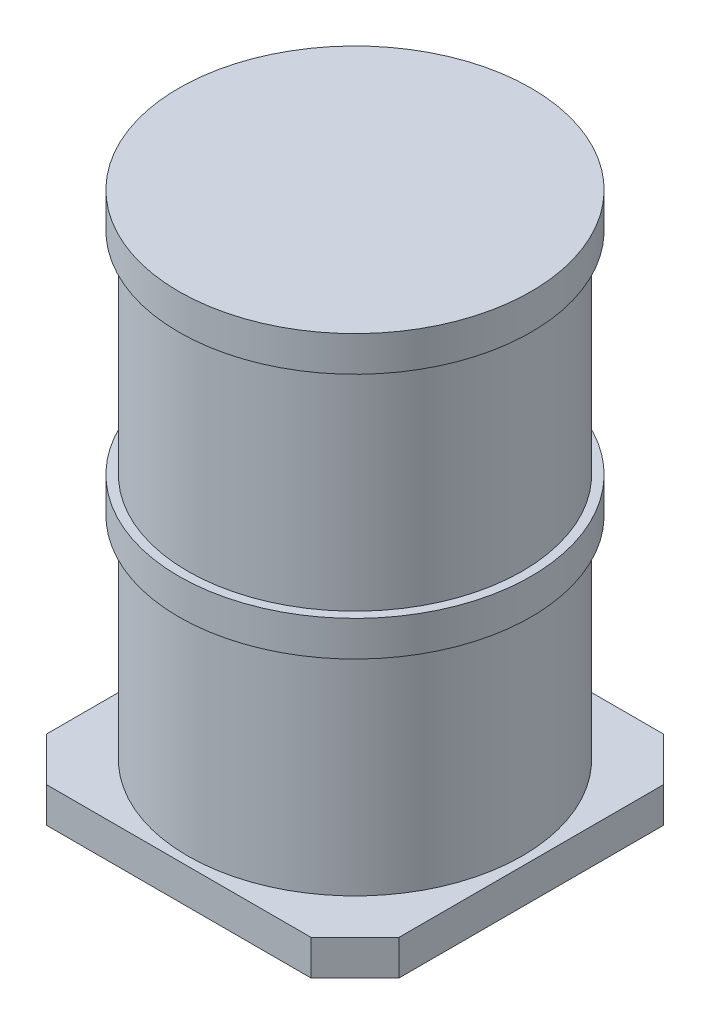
ISO-10303-21;
HEADER;
FILE_DESCRIPTION(('STEP AP214'),'2;1');
FILE_NAME('part.step','',(''),(''),'','','');
FILE_SCHEMA(('AUTOMOTIVE_DESIGN { 1 0 10303 214 1 1 1 1 }'));
ENDSEC;
DATA;
#1=APPLICATION_CONTEXT('core data for automotive mechanical design processes');
#2=APPLICATION_PROTOCOL_DEFINITION('international standard','automotive_design',2000,#1);
#3=PRODUCT_CONTEXT('',#1,'mechanical');
#4=PRODUCT('Part','Part','',(#3));
#5=PRODUCT_RELATED_PRODUCT_CATEGORY('part','',(#4));
#6=PRODUCT_DEFINITION_FORMATION('','',#4);
#7=PRODUCT_DEFINITION_CONTEXT('part definition',#1,'design');
#8=PRODUCT_DEFINITION('design','',#6,#7);
#9=PRODUCT_DEFINITION_SHAPE('','',#8);
#10=(LENGTH_UNIT() NAMED_UNIT(*) SI_UNIT(.MILLI.,.METRE.));
#11=(NAMED_UNIT(*) PLANE_ANGLE_UNIT() SI_UNIT($,.RADIAN.));
#12=(NAMED_UNIT(*) SI_UNIT($,.STERADIAN.) SOLID_ANGLE_UNIT());
#13=UNCERTAINTY_MEASURE_WITH_UNIT(LENGTH_MEASURE(1.E-05),#10,'distance_accuracy_value','');
#14=(GEOMETRIC_REPRESENTATION_CONTEXT(3) GLOBAL_UNCERTAINTY_ASSIGNED_CONTEXT((#13)) GLOBAL_UNIT_ASSIGNED_CONTEXT((#10,
#11,#12)) REPRESENTATION_CONTEXT('',''));
#15=CARTESIAN_POINT('',(0.,0.,0.));
#16=DIRECTION('',(0.,0.,1.));
#17=DIRECTION('',(1.,0.,0.));
#18=AXIS2_PLACEMENT_3D('',#15,#16,#17);
#19=CARTESIAN_POINT('',(0.,3.048,0.));
#20=DIRECTION('',(0.,-1.,0.));
#21=DIRECTION('',(0.,0.,-1.));
#22=AXIS2_PLACEMENT_3D('',#19,#20,#21);
#23=CYLINDRICAL_SURFACE('',#22,2.413);
#24=CARTESIAN_POINT('',(0.,3.048,0.));
#25=DIRECTION('',(0.,1.,0.));
#26=DIRECTION('',(0.,0.,1.));
#27=AXIS2_PLACEMENT_3D('',#24,#25,#26);
#28=CIRCLE('',#27,2.413);
#29=CARTESIAN_POINT('',(0.,3.048,-2.413));
#30=VERTEX_POINT('',#29);
#31=EDGE_CURVE('E169',#30,#30,#28,.T.);
#32=CARTESIAN_POINT('',(0.,0.,0.));
#33=DIRECTION('',(0.,1.,0.));
#34=DIRECTION('',(0.,0.,1.));
#35=AXIS2_PLACEMENT_3D('',#32,#33,#34);
#36=CIRCLE('',#35,2.413);
#37=CARTESIAN_POINT('',(0.,0.,-2.413));
#38=VERTEX_POINT('',#37);
#39=EDGE_CURVE('E155',#38,#38,#36,.T.);
#40=CARTESIAN_POINT('',(0.,3.048,-2.413));
#41=CARTESIAN_POINT('',(0.,3.01625,-2.413));
#42=CARTESIAN_POINT('',(0.,2.9845,-2.413));
#43=CARTESIAN_POINT('',(0.,2.921,-2.413));
#44=CARTESIAN_POINT('',(0.,2.88925,-2.413));
#45=CARTESIAN_POINT('',(0.,2.82575,-2.413));
#46=CARTESIAN_POINT('',(0.,2.794,-2.413));
#47=CARTESIAN_POINT('',(0.,2.7305,-2.413));
#48=CARTESIAN_POINT('',(0.,2.69875,-2.413));
#49=CARTESIAN_POINT('',(0.,2.63525,-2.413));
#50=CARTESIAN_POINT('',(0.,2.6035,-2.413));
#51=CARTESIAN_POINT('',(0.,2.54,-2.413));
#52=CARTESIAN_POINT('',(0.,2.50825,-2.413));
#53=CARTESIAN_POINT('',(0.,2.44475,-2.413));
#54=CARTESIAN_POINT('',(0.,2.413,-2.413));
#55=CARTESIAN_POINT('',(0.,2.3495,-2.413));
#56=CARTESIAN_POINT('',(0.,2.31775,-2.413));
#57=CARTESIAN_POINT('',(0.,2.25425,-2.413));
#58=CARTESIAN_POINT('',(0.,2.2225,-2.413));
#59=CARTESIAN_POINT('',(0.,2.159,-2.413));
#60=CARTESIAN_POINT('',(0.,2.12725,-2.413));
#61=CARTESIAN_POINT('',(0.,2.06375,-2.413));
#62=CARTESIAN_POINT('',(0.,2.032,-2.413));
#63=CARTESIAN_POINT('',(0.,1.9685,-2.413));
#64=CARTESIAN_POINT('',(0.,1.93675,-2.413));
#65=CARTESIAN_POINT('',(0.,1.87325,-2.413));
#66=CARTESIAN_POINT('',(0.,1.8415,-2.413));
#67=CARTESIAN_POINT('',(0.,1.778,-2.413));
#68=CARTESIAN_POINT('',(0.,1.74625,-2.413));
#69=CARTESIAN_POINT('',(0.,1.68275,-2.413));
#70=CARTESIAN_POINT('',(0.,1.651,-2.413));
#71=CARTESIAN_POINT('',(0.,1.5875,-2.413));
#72=CARTESIAN_POINT('',(0.,1.55575,-2.413));
#73=CARTESIAN_POINT('',(0.,1.49225,-2.413));
#74=CARTESIAN_POINT('',(0.,1.4605,-2.413));
#75=CARTESIAN_POINT('',(0.,1.397,-2.413));
#76=CARTESIAN_POINT('',(0.,1.36525,-2.413));
#77=CARTESIAN_POINT('',(0.,1.30175,-2.413));
#78=CARTESIAN_POINT('',(0.,1.27,-2.413));
#79=CARTESIAN_POINT('',(0.,1.2065,-2.413));
#80=CARTESIAN_POINT('',(0.,1.17475,-2.413));
#81=CARTESIAN_POINT('',(0.,1.11125,-2.413));
#82=CARTESIAN_POINT('',(0.,1.0795,-2.413));
#83=CARTESIAN_POINT('',(0.,1.016,-2.413));
#84=CARTESIAN_POINT('',(0.,0.98425,-2.413));
#85=CARTESIAN_POINT('',(0.,0.92075,-2.413));
#86=CARTESIAN_POINT('',(0.,0.889,-2.413));
#87=CARTESIAN_POINT('',(0.,0.8255,-2.413));
#88=CARTESIAN_POINT('',(0.,0.79375,-2.413));
#89=CARTESIAN_POINT('',(0.,0.73025,-2.413));
#90=CARTESIAN_POINT('',(0.,0.6985,-2.413));
#91=CARTESIAN_POINT('',(0.,0.635,-2.413));
#92=CARTESIAN_POINT('',(0.,0.60325,-2.413));
#93=CARTESIAN_POINT('',(0.,0.53975,-2.413));
#94=CARTESIAN_POINT('',(0.,0.508,-2.413));
#95=CARTESIAN_POINT('',(0.,0.4445,-2.413));
#96=CARTESIAN_POINT('',(0.,0.41275,-2.413));
#97=CARTESIAN_POINT('',(0.,0.34925,-2.413));
#98=CARTESIAN_POINT('',(0.,0.3175,-2.413));
#99=CARTESIAN_POINT('',(0.,0.254,-2.413));
#100=CARTESIAN_POINT('',(0.,0.22225,-2.413));
#101=CARTESIAN_POINT('',(0.,0.15875,-2.413));
#102=CARTESIAN_POINT('',(0.,0.127,-2.413));
#103=CARTESIAN_POINT('',(0.,0.0634999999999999,-2.413));
#104=CARTESIAN_POINT('',(0.,0.03175,-2.413));
#105=CARTESIAN_POINT('',(0.,0.,-2.413));
#106=B_SPLINE_CURVE_WITH_KNOTS('',3,(#40,#41,#42,#43,#44,#45,#46,#47,#48,#49,#50,#51,#52,#53,
#54,#55,#56,#57,#58,#59,#60,#61,#62,#63,#64,#65,#66,#67,#68,#69,#70,#71,#72,#73,#74,#75,#76,#77,
#78,#79,#80,#81,#82,#83,#84,#85,#86,#87,#88,#89,#90,#91,#92,#93,#94,#95,#96,#97,#98,#99,#100,
#101,#102,#103,#104,#105),.UNSPECIFIED.,.F.,.F.,(4,2,2,2,2,2,2,2,2,2,2,2,2,2,2,2,2,2,2,2,2,2,2,
2,2,2,2,2,2,2,2,2,4),(0.,0.0952499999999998,0.1905,0.28575,0.381,0.47625,0.5715,0.66675,0.762,
0.85725,0.9525,1.04775,1.143,1.23825,1.3335,1.42875,1.524,1.61925,1.7145,1.80975,1.905,2.00025,
2.0955,2.19075,2.286,2.38125,2.4765,2.57175,2.667,2.76225,2.8575,2.95275,3.048),.UNSPECIFIED.);
#107=EDGE_CURVE('BSEAM45',#30,#38,#106,.T.);
#108=ORIENTED_EDGE('',*,*,#31,.F.);
#109=ORIENTED_EDGE('',*,*,#39,.T.);
#110=ORIENTED_EDGE('',*,*,#107,.T.);
#111=ORIENTED_EDGE('',*,*,#107,.F.);
#112=EDGE_LOOP('',(#108,#110,#109,#111));
#113=FACE_BOUND('',#112,.T.);
#114=ADVANCED_FACE('F45',(#113),#23,.T.);
#115=CARTESIAN_POINT('',(0.,3.556,0.));
#116=DIRECTION('',(0.,-1.,0.));
#117=DIRECTION('',(0.,0.,-1.));
#118=AXIS2_PLACEMENT_3D('',#115,#116,#117);
#119=CYLINDRICAL_SURFACE('',#118,2.54);
#120=CARTESIAN_POINT('',(0.,3.556,0.));
#121=DIRECTION('',(0.,1.,0.));
#122=DIRECTION('',(0.,0.,1.));
#123=AXIS2_PLACEMENT_3D('',#120,#121,#122);
#124=CIRCLE('',#123,2.54);
#125=CARTESIAN_POINT('',(0.,3.556,2.54));
#126=VERTEX_POINT('',#125);
#127=EDGE_CURVE('E166',#126,#126,#124,.T.);
#128=ORIENTED_EDGE('',*,*,#127,.F.);
#129=EDGE_LOOP('',(#128));
#130=FACE_BOUND('',#129,.T.);
#131=CARTESIAN_POINT('',(0.,3.048,0.));
#132=DIRECTION('',(0.,1.,0.));
#133=DIRECTION('',(0.,0.,1.));
#134=AXIS2_PLACEMENT_3D('',#131,#132,#133);
#135=CIRCLE('',#134,2.54);
#136=CARTESIAN_POINT('',(0.,3.048,2.54));
#137=VERTEX_POINT('',#136);
#138=EDGE_CURVE('E161',#137,#137,#135,.T.);
#139=ORIENTED_EDGE('',*,*,#138,.T.);
#140=EDGE_LOOP('',(#139));
#141=FACE_BOUND('',#140,.T.);
#142=ADVANCED_FACE('F242',(#130,#141),#119,.T.);
#143=CARTESIAN_POINT('',(0.,3.556,0.));
#144=DIRECTION('',(0.,1.,0.));
#145=DIRECTION('',(0.,0.,1.));
#146=AXIS2_PLACEMENT_3D('',#143,#144,#145);
#147=PLANE('',#146);
#148=CARTESIAN_POINT('',(0.,3.556,0.));
#149=DIRECTION('',(0.,1.,0.));
#150=DIRECTION('',(0.,0.,1.));
#151=AXIS2_PLACEMENT_3D('',#148,#149,#150);
#152=CIRCLE('',#151,2.413);
#153=CARTESIAN_POINT('',(0.,3.556,-2.413));
#154=VERTEX_POINT('',#153);
#155=EDGE_CURVE('E13',#154,#154,#152,.T.);
#156=ORIENTED_EDGE('',*,*,#155,.F.);
#157=EDGE_LOOP('',(#156));
#158=FACE_BOUND('',#157,.T.);
#159=ORIENTED_EDGE('',*,*,#127,.T.);
#160=EDGE_LOOP('',(#159));
#161=FACE_BOUND('',#160,.T.);
#162=ADVANCED_FACE('F248',(#158,#161),#147,.T.);
#163=CARTESIAN_POINT('',(0.,3.048,0.));
#164=DIRECTION('',(0.,1.,0.));
#165=DIRECTION('',(0.,0.,1.));
#166=AXIS2_PLACEMENT_3D('',#163,#164,#165);
#167=PLANE('',#166);
#168=ORIENTED_EDGE('',*,*,#31,.T.);
#169=EDGE_LOOP('',(#168));
#170=FACE_BOUND('',#169,.T.);
#171=ORIENTED_EDGE('',*,*,#138,.F.);
#172=EDGE_LOOP('',(#171));
#173=FACE_BOUND('',#172,.T.);
#174=ADVANCED_FACE('F298',(#170,#173),#167,.F.);
#175=CARTESIAN_POINT('',(2.54,-0.508,-2.54));
#176=DIRECTION('',(-1.,0.,0.));
#177=DIRECTION('',(0.,0.,1.));
#178=AXIS2_PLACEMENT_3D('',#175,#176,#177);
#179=PLANE('',#178);
#180=DIRECTION('',(0.,0.,1.));
#181=VECTOR('',#180,1.);
#182=CARTESIAN_POINT('',(2.54,-0.508,-2.54));
#183=LINE('',#182,#181);
#184=CARTESIAN_POINT('',(2.54,-0.508,-1.905));
#185=VERTEX_POINT('',#184);
#186=CARTESIAN_POINT('',(2.54,-0.508,1.905));
#187=VERTEX_POINT('',#186);
#188=EDGE_CURVE('E133',#185,#187,#183,.T.);
#189=ORIENTED_EDGE('',*,*,#188,.F.);
#190=DIRECTION('',(0.,1.,0.));
#191=VECTOR('',#190,1.);
#192=CARTESIAN_POINT('',(2.54,-0.508,-1.905));
#193=LINE('',#192,#191);
#194=CARTESIAN_POINT('',(2.54,0.,-1.905));
#195=VERTEX_POINT('',#194);
#196=EDGE_CURVE('E117',#185,#195,#193,.T.);
#197=ORIENTED_EDGE('',*,*,#196,.T.);
#198=DIRECTION('',(0.,0.,1.));
#199=VECTOR('',#198,1.);
#200=CARTESIAN_POINT('',(2.54,0.,-2.54));
#201=LINE('',#200,#199);
#202=CARTESIAN_POINT('',(2.54,0.,1.905));
#203=VERTEX_POINT('',#202);
#204=EDGE_CURVE('E130',#195,#203,#201,.T.);
#205=ORIENTED_EDGE('',*,*,#204,.T.);
#206=DIRECTION('',(0.,-1.,0.));
#207=VECTOR('',#206,1.);
#208=CARTESIAN_POINT('',(2.54,-0.508,1.905));
#209=LINE('',#208,#207);
#210=EDGE_CURVE('E135',#203,#187,#209,.T.);
#211=ORIENTED_EDGE('',*,*,#210,.T.);
#212=EDGE_LOOP('',(#189,#197,#205,#211));
#213=FACE_BOUND('',#212,.T.);
#214=ADVANCED_FACE('F129',(#213),#179,.F.);
#215=CARTESIAN_POINT('',(-2.54,-0.508,2.54));
#216=DIRECTION('',(0.,0.,-1.));
#217=DIRECTION('',(-1.,0.,0.));
#218=AXIS2_PLACEMENT_3D('',#215,#216,#217);
#219=PLANE('',#218);
#220=DIRECTION('',(-1.,0.,0.));
#221=VECTOR('',#220,1.);
#222=CARTESIAN_POINT('',(-2.54,-0.508,2.54));
#223=LINE('',#222,#221);
#224=CARTESIAN_POINT('',(1.905,-0.508,2.54));
#225=VERTEX_POINT('',#224);
#226=CARTESIAN_POINT('',(-1.905,-0.508,2.54));
#227=VERTEX_POINT('',#226);
#228=EDGE_CURVE('E208',#225,#227,#223,.T.);
#229=ORIENTED_EDGE('',*,*,#228,.F.);
#230=DIRECTION('',(0.,1.,0.));
#231=VECTOR('',#230,1.);
#232=CARTESIAN_POINT('',(1.905,-0.508,2.54));
#233=LINE('',#232,#231);
#234=CARTESIAN_POINT('',(1.905,0.,2.54));
#235=VERTEX_POINT('',#234);
#236=EDGE_CURVE('E191',#225,#235,#233,.T.);
#237=ORIENTED_EDGE('',*,*,#236,.T.);
#238=DIRECTION('',(-1.,0.,0.));
#239=VECTOR('',#238,1.);
#240=CARTESIAN_POINT('',(-2.54,0.,2.54));
#241=LINE('',#240,#239);
#242=CARTESIAN_POINT('',(-1.905,0.,2.54));
#243=VERTEX_POINT('',#242);
#244=EDGE_CURVE('E139',#235,#243,#241,.T.);
#245=ORIENTED_EDGE('',*,*,#244,.T.);
#246=DIRECTION('',(0.,-1.,0.));
#247=VECTOR('',#246,1.);
#248=CARTESIAN_POINT('',(-1.905,-0.508,2.54));
#249=LINE('',#248,#247);
#250=EDGE_CURVE('E189',#243,#227,#249,.T.);
#251=ORIENTED_EDGE('',*,*,#250,.T.);
#252=EDGE_LOOP('',(#229,#237,#245,#251));
#253=FACE_BOUND('',#252,.T.);
#254=ADVANCED_FACE('F273',(#253),#219,.F.);
#255=CARTESIAN_POINT('',(-2.54,-0.508,-2.54));
#256=DIRECTION('',(1.,0.,0.));
#257=DIRECTION('',(0.,0.,-1.));
#258=AXIS2_PLACEMENT_3D('',#255,#256,#257);
#259=PLANE('',#258);
#260=DIRECTION('',(0.,0.,-1.));
#261=VECTOR('',#260,1.);
#262=CARTESIAN_POINT('',(-2.54,0.,-2.54));
#263=LINE('',#262,#261);
#264=CARTESIAN_POINT('',(-2.54,0.,1.905));
#265=VERTEX_POINT('',#264);
#266=CARTESIAN_POINT('',(-2.54,0.,-1.905));
#267=VERTEX_POINT('',#266);
#268=EDGE_CURVE('E143',#265,#267,#263,.T.);
#269=ORIENTED_EDGE('',*,*,#268,.T.);
#270=DIRECTION('',(0.,-1.,0.));
#271=VECTOR('',#270,1.);
#272=CARTESIAN_POINT('',(-2.54,-0.508,-1.905));
#273=LINE('',#272,#271);
#274=CARTESIAN_POINT('',(-2.54,-0.508,-1.905));
#275=VERTEX_POINT('',#274);
#276=EDGE_CURVE('E49',#267,#275,#273,.T.);
#277=ORIENTED_EDGE('',*,*,#276,.T.);
#278=DIRECTION('',(0.,0.,-1.));
#279=VECTOR('',#278,1.);
#280=CARTESIAN_POINT('',(-2.54,-0.508,-2.54));
#281=LINE('',#280,#279);
#282=CARTESIAN_POINT('',(-2.54,-0.508,1.905));
#283=VERTEX_POINT('',#282);
#284=EDGE_CURVE('E198',#283,#275,#281,.T.);
#285=ORIENTED_EDGE('',*,*,#284,.F.);
#286=DIRECTION('',(0.,1.,0.));
#287=VECTOR('',#286,1.);
#288=CARTESIAN_POINT('',(-2.54,-0.508,1.905));
#289=LINE('',#288,#287);
#290=EDGE_CURVE('E193',#283,#265,#289,.T.);
#291=ORIENTED_EDGE('',*,*,#290,.T.);
#292=EDGE_LOOP('',(#269,#277,#285,#291));
#293=FACE_BOUND('',#292,.T.);
#294=ADVANCED_FACE('F197',(#293),#259,.F.);
#295=CARTESIAN_POINT('',(-2.54,-0.508,-2.54));
#296=DIRECTION('',(0.,0.,1.));
#297=DIRECTION('',(1.,0.,0.));
#298=AXIS2_PLACEMENT_3D('',#295,#296,#297);
#299=PLANE('',#298);
#300=DIRECTION('',(1.,0.,0.));
#301=VECTOR('',#300,1.);
#302=CARTESIAN_POINT('',(-2.54,0.,-2.54));
#303=LINE('',#302,#301);
#304=CARTESIAN_POINT('',(-1.905,0.,-2.54));
#305=VERTEX_POINT('',#304);
#306=CARTESIAN_POINT('',(1.905,0.,-2.54));
#307=VERTEX_POINT('',#306);
#308=EDGE_CURVE('E153',#305,#307,#303,.T.);
#309=ORIENTED_EDGE('',*,*,#308,.T.);
#310=DIRECTION('',(0.,-1.,0.));
#311=VECTOR('',#310,1.);
#312=CARTESIAN_POINT('',(1.905,-0.508,-2.54));
#313=LINE('',#312,#311);
#314=CARTESIAN_POINT('',(1.905,-0.508,-2.54));
#315=VERTEX_POINT('',#314);
#316=EDGE_CURVE('E118',#307,#315,#313,.T.);
#317=ORIENTED_EDGE('',*,*,#316,.T.);
#318=DIRECTION('',(1.,0.,0.));
#319=VECTOR('',#318,1.);
#320=CARTESIAN_POINT('',(-2.54,-0.508,-2.54));
#321=LINE('',#320,#319);
#322=CARTESIAN_POINT('',(-1.905,-0.508,-2.54));
#323=VERTEX_POINT('',#322);
#324=EDGE_CURVE('E149',#323,#315,#321,.T.);
#325=ORIENTED_EDGE('',*,*,#324,.F.);
#326=DIRECTION('',(0.,1.,0.));
#327=VECTOR('',#326,1.);
#328=CARTESIAN_POINT('',(-1.905,-0.508,-2.54));
#329=LINE('',#328,#327);
#330=EDGE_CURVE('E123',#323,#305,#329,.T.);
#331=ORIENTED_EDGE('',*,*,#330,.T.);
#332=EDGE_LOOP('',(#309,#317,#325,#331));
#333=FACE_BOUND('',#332,.T.);
#334=ADVANCED_FACE('F206',(#333),#299,.F.);
#335=CARTESIAN_POINT('',(0.,-0.508,0.));
#336=DIRECTION('',(0.,1.,0.));
#337=DIRECTION('',(0.,0.,1.));
#338=AXIS2_PLACEMENT_3D('',#335,#336,#337);
#339=PLANE('',#338);
#340=CARTESIAN_POINT('',(0.,-0.508,0.));
#341=DIRECTION('',(0.,-1.,0.));
#342=DIRECTION('',(0.,0.,-1.));
#343=AXIS2_PLACEMENT_3D('',#340,#341,#342);
#344=CIRCLE('',#343,1.016);
#345=CARTESIAN_POINT('',(0.,-0.508,-1.016));
#346=VERTEX_POINT('',#345);
#347=EDGE_CURVE('E146',#346,#346,#344,.T.);
#348=ORIENTED_EDGE('',*,*,#347,.F.);
#349=EDGE_LOOP('',(#348));
#350=FACE_BOUND('',#349,.T.);
#351=ORIENTED_EDGE('',*,*,#324,.T.);
#352=DIRECTION('',(-0.707106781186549,0.,-0.707106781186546));
#353=VECTOR('',#352,1.);
#354=CARTESIAN_POINT('',(2.54,-0.508,-1.905));
#355=LINE('',#354,#353);
#356=EDGE_CURVE('E187',#315,#185,#355,.F.);
#357=ORIENTED_EDGE('',*,*,#356,.T.);
#358=ORIENTED_EDGE('',*,*,#188,.T.);
#359=DIRECTION('',(0.707106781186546,0.,-0.707106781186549));
#360=VECTOR('',#359,1.);
#361=CARTESIAN_POINT('',(1.905,-0.508,2.54));
#362=LINE('',#361,#360);
#363=EDGE_CURVE('E185',#187,#225,#362,.F.);
#364=ORIENTED_EDGE('',*,*,#363,.T.);
#365=ORIENTED_EDGE('',*,*,#228,.T.);
#366=DIRECTION('',(0.707106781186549,0.,0.707106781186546));
#367=VECTOR('',#366,1.);
#368=CARTESIAN_POINT('',(-2.54,-0.508,1.905));
#369=LINE('',#368,#367);
#370=EDGE_CURVE('E68',#227,#283,#369,.F.);
#371=ORIENTED_EDGE('',*,*,#370,.T.);
#372=ORIENTED_EDGE('',*,*,#284,.T.);
#373=DIRECTION('',(-0.707106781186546,0.,0.707106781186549));
#374=VECTOR('',#373,1.);
#375=CARTESIAN_POINT('',(-1.905,-0.508,-2.54));
#376=LINE('',#375,#374);
#377=EDGE_CURVE('E183',#275,#323,#376,.F.);
#378=ORIENTED_EDGE('',*,*,#377,.T.);
#379=EDGE_LOOP('',(#351,#357,#358,#364,#365,#371,#372,#378));
#380=FACE_BOUND('',#379,.T.);
#381=ADVANCED_FACE('F275',(#350,#380),#339,.F.);
#382=CARTESIAN_POINT('',(0.,0.,0.));
#383=DIRECTION('',(0.,1.,0.));
#384=DIRECTION('',(0.,0.,1.));
#385=AXIS2_PLACEMENT_3D('',#382,#383,#384);
#386=PLANE('',#385);
#387=ORIENTED_EDGE('',*,*,#39,.F.);
#388=EDGE_LOOP('',(#387));
#389=FACE_BOUND('',#388,.T.);
#390=ORIENTED_EDGE('',*,*,#204,.F.);
#391=DIRECTION('',(0.707106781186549,0.,0.707106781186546));
#392=VECTOR('',#391,1.);
#393=CARTESIAN_POINT('',(2.2225,0.,-2.2225));
#394=LINE('',#393,#392);
#395=EDGE_CURVE('E113',#195,#307,#394,.F.);
#396=ORIENTED_EDGE('',*,*,#395,.T.);
#397=ORIENTED_EDGE('',*,*,#308,.F.);
#398=DIRECTION('',(0.707106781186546,0.,-0.707106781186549));
#399=VECTOR('',#398,1.);
#400=CARTESIAN_POINT('',(-2.2225,0.,-2.2225));
#401=LINE('',#400,#399);
#402=EDGE_CURVE('E176',#305,#267,#401,.F.);
#403=ORIENTED_EDGE('',*,*,#402,.T.);
#404=ORIENTED_EDGE('',*,*,#268,.F.);
#405=DIRECTION('',(-0.707106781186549,0.,-0.707106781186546));
#406=VECTOR('',#405,1.);
#407=CARTESIAN_POINT('',(-2.2225,0.,2.2225));
#408=LINE('',#407,#406);
#409=EDGE_CURVE('E134',#265,#243,#408,.F.);
#410=ORIENTED_EDGE('',*,*,#409,.T.);
#411=ORIENTED_EDGE('',*,*,#244,.F.);
#412=DIRECTION('',(-0.707106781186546,0.,0.707106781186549));
#413=VECTOR('',#412,1.);
#414=CARTESIAN_POINT('',(2.2225,0.,2.2225));
#415=LINE('',#414,#413);
#416=EDGE_CURVE('E124',#235,#203,#415,.F.);
#417=ORIENTED_EDGE('',*,*,#416,.T.);
#418=EDGE_LOOP('',(#390,#396,#397,#403,#404,#410,#411,#417));
#419=FACE_BOUND('',#418,.T.);
#420=ADVANCED_FACE('F137',(#389,#419),#386,.T.);
#421=CARTESIAN_POINT('',(0.,0.762,0.));
#422=DIRECTION('',(0.,-1.,0.));
#423=DIRECTION('',(0.,0.,-1.));
#424=AXIS2_PLACEMENT_3D('',#421,#422,#423);
#425=CYLINDRICAL_SURFACE('',#424,1.016);
#426=CARTESIAN_POINT('',(0.,0.762,0.));
#427=DIRECTION('',(0.,-1.,0.));
#428=DIRECTION('',(0.,0.,-1.));
#429=AXIS2_PLACEMENT_3D('',#426,#427,#428);
#430=CIRCLE('',#429,1.016);
#431=CARTESIAN_POINT('',(0.,0.762,-1.016));
#432=VERTEX_POINT('',#431);
#433=EDGE_CURVE('E140',#432,#432,#430,.T.);
#434=ORIENTED_EDGE('',*,*,#433,.F.);
#435=EDGE_LOOP('',(#434));
#436=FACE_BOUND('',#435,.T.);
#437=ORIENTED_EDGE('',*,*,#347,.T.);
#438=EDGE_LOOP('',(#437));
#439=FACE_BOUND('',#438,.T.);
#440=ADVANCED_FACE('F284',(#436,#439),#425,.F.);
#441=CARTESIAN_POINT('',(0.,0.762,0.));
#442=DIRECTION('',(0.,-1.,0.));
#443=DIRECTION('',(0.,0.,-1.));
#444=AXIS2_PLACEMENT_3D('',#441,#442,#443);
#445=PLANE('',#444);
#446=ORIENTED_EDGE('',*,*,#433,.T.);
#447=EDGE_LOOP('',(#446));
#448=FACE_BOUND('',#447,.T.);
#449=ADVANCED_FACE('F258',(#448),#445,.T.);
#450=CARTESIAN_POINT('',(2.54,-0.508,-1.905));
#451=DIRECTION('',(-0.707106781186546,0.,0.707106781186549));
#452=DIRECTION('',(0.,1.,0.));
#453=AXIS2_PLACEMENT_3D('',#450,#451,#452);
#454=PLANE('',#453);
#455=ORIENTED_EDGE('',*,*,#356,.F.);
#456=ORIENTED_EDGE('',*,*,#316,.F.);
#457=ORIENTED_EDGE('',*,*,#395,.F.);
#458=ORIENTED_EDGE('',*,*,#196,.F.);
#459=EDGE_LOOP('',(#455,#456,#457,#458));
#460=FACE_BOUND('',#459,.T.);
#461=ADVANCED_FACE('F116',(#460),#454,.F.);
#462=CARTESIAN_POINT('',(1.905,-0.508,2.54));
#463=DIRECTION('',(-0.707106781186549,0.,-0.707106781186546));
#464=DIRECTION('',(0.,1.,0.));
#465=AXIS2_PLACEMENT_3D('',#462,#463,#464);
#466=PLANE('',#465);
#467=ORIENTED_EDGE('',*,*,#363,.F.);
#468=ORIENTED_EDGE('',*,*,#210,.F.);
#469=ORIENTED_EDGE('',*,*,#416,.F.);
#470=ORIENTED_EDGE('',*,*,#236,.F.);
#471=EDGE_LOOP('',(#467,#468,#469,#470));
#472=FACE_BOUND('',#471,.T.);
#473=ADVANCED_FACE('F257',(#472),#466,.F.);
#474=CARTESIAN_POINT('',(-1.905,-0.508,-2.54));
#475=DIRECTION('',(0.707106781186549,0.,0.707106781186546));
#476=DIRECTION('',(0.,1.,0.));
#477=AXIS2_PLACEMENT_3D('',#474,#475,#476);
#478=PLANE('',#477);
#479=ORIENTED_EDGE('',*,*,#377,.F.);
#480=ORIENTED_EDGE('',*,*,#276,.F.);
#481=ORIENTED_EDGE('',*,*,#402,.F.);
#482=ORIENTED_EDGE('',*,*,#330,.F.);
#483=EDGE_LOOP('',(#479,#480,#481,#482));
#484=FACE_BOUND('',#483,.T.);
#485=ADVANCED_FACE('F203',(#484),#478,.F.);
#486=CARTESIAN_POINT('',(-2.54,-0.508,1.905));
#487=DIRECTION('',(0.707106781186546,0.,-0.707106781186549));
#488=DIRECTION('',(0.,1.,0.));
#489=AXIS2_PLACEMENT_3D('',#486,#487,#488);
#490=PLANE('',#489);
#491=ORIENTED_EDGE('',*,*,#370,.F.);
#492=ORIENTED_EDGE('',*,*,#250,.F.);
#493=ORIENTED_EDGE('',*,*,#409,.F.);
#494=ORIENTED_EDGE('',*,*,#290,.F.);
#495=EDGE_LOOP('',(#491,#492,#493,#494));
#496=FACE_BOUND('',#495,.T.);
#497=ADVANCED_FACE('F47',(#496),#490,.F.);
#498=CARTESIAN_POINT('',(0.,6.604,0.));
#499=DIRECTION('',(0.,-1.,0.));
#500=DIRECTION('',(0.,0.,-1.));
#501=AXIS2_PLACEMENT_3D('',#498,#499,#500);
#502=CYLINDRICAL_SURFACE('',#501,2.413);
#503=CARTESIAN_POINT('',(0.,6.604,0.));
#504=DIRECTION('',(0.,1.,0.));
#505=DIRECTION('',(0.,0.,1.));
#506=AXIS2_PLACEMENT_3D('',#503,#504,#505);
#507=CIRCLE('',#506,2.413);
#508=CARTESIAN_POINT('',(0.,6.604,-2.413));
#509=VERTEX_POINT('',#508);
#510=EDGE_CURVE('E165',#509,#509,#507,.T.);
#511=CARTESIAN_POINT('',(0.,6.604,-2.413));
#512=CARTESIAN_POINT('',(0.,6.57225,-2.413));
#513=CARTESIAN_POINT('',(0.,6.5405,-2.413));
#514=CARTESIAN_POINT('',(0.,6.477,-2.413));
#515=CARTESIAN_POINT('',(0.,6.44525,-2.413));
#516=CARTESIAN_POINT('',(0.,6.38175,-2.413));
#517=CARTESIAN_POINT('',(0.,6.35,-2.413));
#518=CARTESIAN_POINT('',(0.,6.2865,-2.413));
#519=CARTESIAN_POINT('',(0.,6.25475,-2.413));
#520=CARTESIAN_POINT('',(0.,6.19125,-2.413));
#521=CARTESIAN_POINT('',(0.,6.1595,-2.413));
#522=CARTESIAN_POINT('',(0.,6.096,-2.413));
#523=CARTESIAN_POINT('',(0.,6.06425,-2.413));
#524=CARTESIAN_POINT('',(0.,6.00075,-2.413));
#525=CARTESIAN_POINT('',(0.,5.969,-2.413));
#526=CARTESIAN_POINT('',(0.,5.9055,-2.413));
#527=CARTESIAN_POINT('',(0.,5.87375,-2.413));
#528=CARTESIAN_POINT('',(0.,5.81025,-2.413));
#529=CARTESIAN_POINT('',(0.,5.7785,-2.413));
#530=CARTESIAN_POINT('',(0.,5.715,-2.413));
#531=CARTESIAN_POINT('',(0.,5.68325,-2.413));
#532=CARTESIAN_POINT('',(0.,5.61975,-2.413));
#533=CARTESIAN_POINT('',(0.,5.588,-2.413));
#534=CARTESIAN_POINT('',(0.,5.5245,-2.413));
#535=CARTESIAN_POINT('',(0.,5.49275,-2.413));
#536=CARTESIAN_POINT('',(0.,5.42925,-2.413));
#537=CARTESIAN_POINT('',(0.,5.3975,-2.413));
#538=CARTESIAN_POINT('',(0.,5.334,-2.413));
#539=CARTESIAN_POINT('',(0.,5.30225,-2.413));
#540=CARTESIAN_POINT('',(0.,5.23875,-2.413));
#541=CARTESIAN_POINT('',(0.,5.207,-2.413));
#542=CARTESIAN_POINT('',(0.,5.1435,-2.413));
#543=CARTESIAN_POINT('',(0.,5.11175,-2.413));
#544=CARTESIAN_POINT('',(0.,5.04825,-2.413));
#545=CARTESIAN_POINT('',(0.,5.0165,-2.413));
#546=CARTESIAN_POINT('',(0.,4.953,-2.413));
#547=CARTESIAN_POINT('',(0.,4.92125,-2.413));
#548=CARTESIAN_POINT('',(0.,4.85775,-2.413));
#549=CARTESIAN_POINT('',(0.,4.826,-2.413));
#550=CARTESIAN_POINT('',(0.,4.7625,-2.413));
#551=CARTESIAN_POINT('',(0.,4.73075,-2.413));
#552=CARTESIAN_POINT('',(0.,4.66725,-2.413));
#553=CARTESIAN_POINT('',(0.,4.6355,-2.413));
#554=CARTESIAN_POINT('',(0.,4.572,-2.413));
#555=CARTESIAN_POINT('',(0.,4.54025,-2.413));
#556=CARTESIAN_POINT('',(0.,4.47675,-2.413));
#557=CARTESIAN_POINT('',(0.,4.445,-2.413));
#558=CARTESIAN_POINT('',(0.,4.3815,-2.413));
#559=CARTESIAN_POINT('',(0.,4.34975,-2.413));
#560=CARTESIAN_POINT('',(0.,4.28625,-2.413));
#561=CARTESIAN_POINT('',(0.,4.2545,-2.413));
#562=CARTESIAN_POINT('',(0.,4.191,-2.413));
#563=CARTESIAN_POINT('',(0.,4.15925,-2.413));
#564=CARTESIAN_POINT('',(0.,4.09575,-2.413));
#565=CARTESIAN_POINT('',(0.,4.064,-2.413));
#566=CARTESIAN_POINT('',(0.,4.0005,-2.413));
#567=CARTESIAN_POINT('',(0.,3.96875,-2.413));
#568=CARTESIAN_POINT('',(0.,3.90525,-2.413));
#569=CARTESIAN_POINT('',(0.,3.8735,-2.413));
#570=CARTESIAN_POINT('',(0.,3.81,-2.413));
#571=CARTESIAN_POINT('',(0.,3.77825,-2.413));
#572=CARTESIAN_POINT('',(0.,3.71475,-2.413));
#573=CARTESIAN_POINT('',(0.,3.683,-2.413));
#574=CARTESIAN_POINT('',(0.,3.6195,-2.413));
#575=CARTESIAN_POINT('',(0.,3.58775,-2.413));
#576=CARTESIAN_POINT('',(0.,3.556,-2.413));
#577=B_SPLINE_CURVE_WITH_KNOTS('',3,(#511,#512,#513,#514,#515,#516,#517,#518,#519,#520,#521,
#522,#523,#524,#525,#526,#527,#528,#529,#530,#531,#532,#533,#534,#535,#536,#537,#538,#539,#540,
#541,#542,#543,#544,#545,#546,#547,#548,#549,#550,#551,#552,#553,#554,#555,#556,#557,#558,#559,
#560,#561,#562,#563,#564,#565,#566,#567,#568,#569,#570,#571,#572,#573,#574,#575,#576),
.UNSPECIFIED.,.F.,.F.,(4,2,2,2,2,2,2,2,2,2,2,2,2,2,2,2,2,2,2,2,2,2,2,2,2,2,2,2,2,2,2,2,4),(0.,
0.0952499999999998,0.1905,0.28575,0.380999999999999,0.476249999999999,0.5715,0.66675,0.762,
0.85725,0.952499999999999,1.04775,1.143,1.23825,1.3335,1.42875,1.524,1.61925,1.7145,1.80975,
1.905,2.00025,2.0955,2.19075,2.286,2.38125,2.4765,2.57175,2.667,2.76225,2.8575,2.95275,3.048),.UNSPECIFIED.);
#578=EDGE_CURVE('BSEAM228',#509,#154,#577,.T.);
#579=ORIENTED_EDGE('',*,*,#510,.F.);
#580=ORIENTED_EDGE('',*,*,#155,.T.);
#581=ORIENTED_EDGE('',*,*,#578,.T.);
#582=ORIENTED_EDGE('',*,*,#578,.F.);
#583=EDGE_LOOP('',(#579,#581,#580,#582));
#584=FACE_BOUND('',#583,.T.);
#585=ADVANCED_FACE('F228',(#584),#502,.T.);
#586=CARTESIAN_POINT('',(0.,7.112,0.));
#587=DIRECTION('',(0.,-1.,0.));
#588=DIRECTION('',(0.,0.,-1.));
#589=AXIS2_PLACEMENT_3D('',#586,#587,#588);
#590=CYLINDRICAL_SURFACE('',#589,2.54);
#591=CARTESIAN_POINT('',(0.,7.112,0.));
#592=DIRECTION('',(0.,1.,0.));
#593=DIRECTION('',(0.,0.,1.));
#594=AXIS2_PLACEMENT_3D('',#591,#592,#593);
#595=CIRCLE('',#594,2.54);
#596=CARTESIAN_POINT('',(0.,7.112,2.54));
#597=VERTEX_POINT('',#596);
#598=EDGE_CURVE('E216',#597,#597,#595,.T.);
#599=ORIENTED_EDGE('',*,*,#598,.F.);
#600=EDGE_LOOP('',(#599));
#601=FACE_BOUND('',#600,.T.);
#602=CARTESIAN_POINT('',(0.,6.604,0.));
#603=DIRECTION('',(0.,1.,0.));
#604=DIRECTION('',(0.,0.,1.));
#605=AXIS2_PLACEMENT_3D('',#602,#603,#604);
#606=CIRCLE('',#605,2.54);
#607=CARTESIAN_POINT('',(0.,6.604,2.54));
#608=VERTEX_POINT('',#607);
#609=EDGE_CURVE('E217',#608,#608,#606,.T.);
#610=ORIENTED_EDGE('',*,*,#609,.T.);
#611=EDGE_LOOP('',(#610));
#612=FACE_BOUND('',#611,.T.);
#613=ADVANCED_FACE('F225',(#601,#612),#590,.T.);
#614=CARTESIAN_POINT('',(0.,7.112,0.));
#615=DIRECTION('',(0.,1.,0.));
#616=DIRECTION('',(0.,0.,1.));
#617=AXIS2_PLACEMENT_3D('',#614,#615,#616);
#618=PLANE('',#617);
#619=ORIENTED_EDGE('',*,*,#598,.T.);
#620=EDGE_LOOP('',(#619));
#621=FACE_BOUND('',#620,.T.);
#622=ADVANCED_FACE('F223',(#621),#618,.T.);
#623=CARTESIAN_POINT('',(0.,6.604,0.));
#624=DIRECTION('',(0.,1.,0.));
#625=DIRECTION('',(0.,0.,1.));
#626=AXIS2_PLACEMENT_3D('',#623,#624,#625);
#627=PLANE('',#626);
#628=ORIENTED_EDGE('',*,*,#510,.T.);
#629=EDGE_LOOP('',(#628));
#630=FACE_BOUND('',#629,.T.);
#631=ORIENTED_EDGE('',*,*,#609,.F.);
#632=EDGE_LOOP('',(#631));
#633=FACE_BOUND('',#632,.T.);
#634=ADVANCED_FACE('F232',(#630,#633),#627,.F.);
#635=CLOSED_SHELL('',(#114,#142,#162,#174,#214,#254,#294,#334,#381,#420,#440,#449,#461,#473,
#485,#497,#585,#613,#622,#634));
#636=CARTESIAN_POINT('',(0.,2.286,0.));
#637=DIRECTION('',(0.,1.,0.));
#638=DIRECTION('',(0.,0.,1.));
#639=AXIS2_PLACEMENT_3D('',#636,#637,#638);
#640=PLANE('',#639);
#641=CARTESIAN_POINT('',(0.,2.286,0.));
#642=DIRECTION('',(0.,1.,0.));
#643=DIRECTION('',(0.,0.,1.));
#644=AXIS2_PLACEMENT_3D('',#641,#642,#643);
#645=CIRCLE('',#644,1.016);
#646=CARTESIAN_POINT('',(0.,2.286,1.016));
#647=VERTEX_POINT('',#646);
#648=EDGE_CURVE('E158',#647,#647,#645,.T.);
#649=ORIENTED_EDGE('',*,*,#648,.T.);
#650=EDGE_LOOP('',(#649));
#651=FACE_BOUND('',#650,.T.);
#652=ADVANCED_FACE('F299',(#651),#640,.T.);
#653=CARTESIAN_POINT('',(0.,2.286,0.));
#654=DIRECTION('',(0.,1.,0.));
#655=DIRECTION('',(0.,0.,1.));
#656=AXIS2_PLACEMENT_3D('',#653,#654,#655);
#657=CYLINDRICAL_SURFACE('',#656,1.016);
#658=ORIENTED_EDGE('',*,*,#648,.F.);
#659=EDGE_LOOP('',(#658));
#660=FACE_BOUND('',#659,.T.);
#661=CARTESIAN_POINT('',(0.,3.556,0.));
#662=DIRECTION('',(0.,1.,0.));
#663=DIRECTION('',(0.,0.,1.));
#664=AXIS2_PLACEMENT_3D('',#661,#662,#663);
#665=CIRCLE('',#664,1.016);
#666=CARTESIAN_POINT('',(0.,3.556,1.016));
#667=VERTEX_POINT('',#666);
#668=EDGE_CURVE('E162',#667,#667,#665,.T.);
#669=ORIENTED_EDGE('',*,*,#668,.T.);
#670=EDGE_LOOP('',(#669));
#671=FACE_BOUND('',#670,.T.);
#672=ADVANCED_FACE('F301',(#660,#671),#657,.F.);
#673=CARTESIAN_POINT('',(0.,3.556,0.));
#674=DIRECTION('',(0.,1.,0.));
#675=DIRECTION('',(0.,0.,1.));
#676=AXIS2_PLACEMENT_3D('',#673,#674,#675);
#677=PLANE('',#676);
#678=ORIENTED_EDGE('',*,*,#668,.F.);
#679=EDGE_LOOP('',(#678));
#680=FACE_BOUND('',#679,.T.);
#681=ADVANCED_FACE('F306',(#680),#677,.F.);
#682=CLOSED_SHELL('',(#652,#672,#681));
#683=ORIENTED_CLOSED_SHELL('',*,#682,.T.);
#684=BREP_WITH_VOIDS('B2',#635,(#683));
#685=ADVANCED_BREP_SHAPE_REPRESENTATION('',(#18,#684),#14);
#686=SHAPE_DEFINITION_REPRESENTATION(#9,#685);
ENDSEC;
END-ISO-10303-21;
